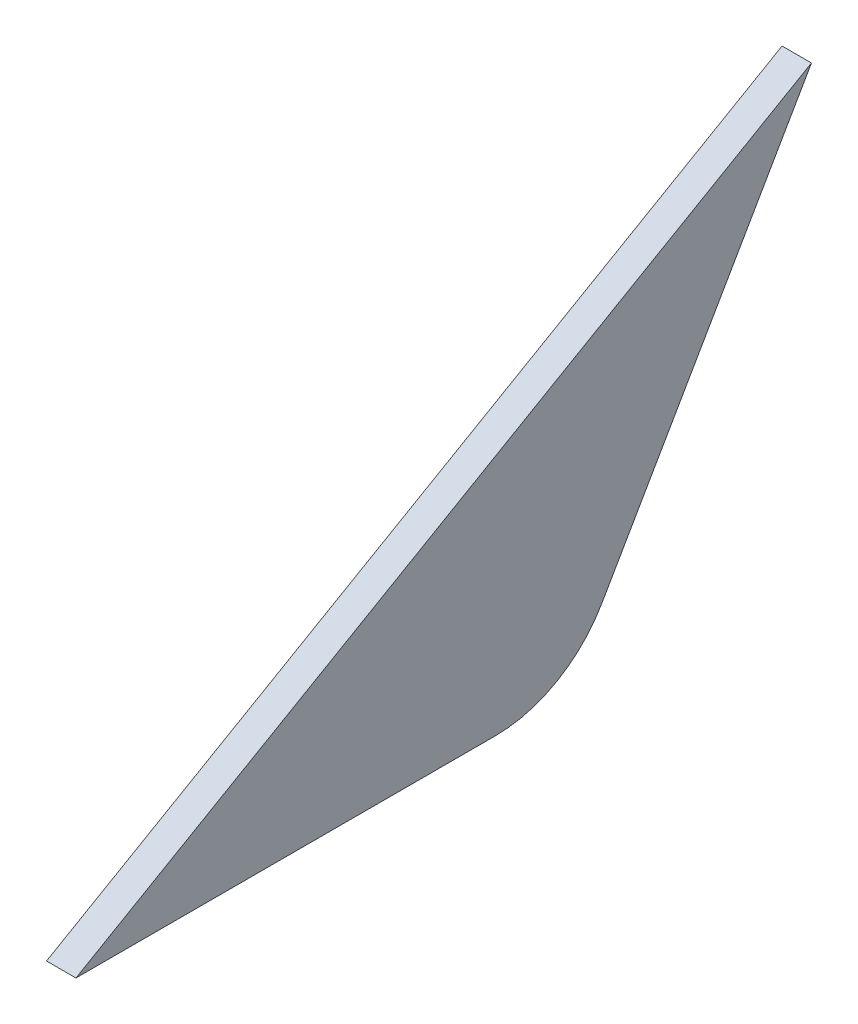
ISO-10303-21;
HEADER;
FILE_DESCRIPTION(('STEP AP214'),'2;1');
FILE_NAME('part.step','',(''),(''),'','','');
FILE_SCHEMA(('AUTOMOTIVE_DESIGN { 1 0 10303 214 1 1 1 1 }'));
ENDSEC;
DATA;
#1=APPLICATION_CONTEXT('core data for automotive mechanical design processes');
#2=APPLICATION_PROTOCOL_DEFINITION('international standard','automotive_design',2000,#1);
#3=PRODUCT_CONTEXT('',#1,'mechanical');
#4=PRODUCT('Part','Part','',(#3));
#5=PRODUCT_RELATED_PRODUCT_CATEGORY('part','',(#4));
#6=PRODUCT_DEFINITION_FORMATION('','',#4);
#7=PRODUCT_DEFINITION_CONTEXT('part definition',#1,'design');
#8=PRODUCT_DEFINITION('design','',#6,#7);
#9=PRODUCT_DEFINITION_SHAPE('','',#8);
#10=(LENGTH_UNIT() NAMED_UNIT(*) SI_UNIT(.MILLI.,.METRE.));
#11=(NAMED_UNIT(*) PLANE_ANGLE_UNIT() SI_UNIT($,.RADIAN.));
#12=(NAMED_UNIT(*) SI_UNIT($,.STERADIAN.) SOLID_ANGLE_UNIT());
#13=UNCERTAINTY_MEASURE_WITH_UNIT(LENGTH_MEASURE(1.E-05),#10,'distance_accuracy_value','');
#14=(GEOMETRIC_REPRESENTATION_CONTEXT(3) GLOBAL_UNCERTAINTY_ASSIGNED_CONTEXT((#13)) GLOBAL_UNIT_ASSIGNED_CONTEXT((#10,
#11,#12)) REPRESENTATION_CONTEXT('',''));
#15=CARTESIAN_POINT('',(0.,0.,0.));
#16=DIRECTION('',(0.,0.,1.));
#17=DIRECTION('',(1.,0.,0.));
#18=AXIS2_PLACEMENT_3D('',#15,#16,#17);
#19=CARTESIAN_POINT('',(343.116830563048,85.0597469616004,-199.739839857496));
#20=DIRECTION('',(0.,-0.866025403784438,-0.5));
#21=DIRECTION('',(0.,0.5,-0.866025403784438));
#22=AXIS2_PLACEMENT_3D('',#19,#20,#21);
#23=PLANE('',#22);
#24=DIRECTION('',(0.,-0.5,0.866025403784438));
#25=VECTOR('',#24,1.);
#26=CARTESIAN_POINT('',(340.068830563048,85.0597469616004,-199.739839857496));
#27=LINE('',#26,#25);
#28=CARTESIAN_POINT('',(340.068830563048,129.05383747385,-275.939839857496));
#29=VERTEX_POINT('',#28);
#30=CARTESIAN_POINT('',(340.068830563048,85.0597469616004,-199.739839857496));
#31=VERTEX_POINT('',#30);
#32=EDGE_CURVE('E98',#29,#31,#27,.T.);
#33=ORIENTED_EDGE('',*,*,#32,.T.);
#34=DIRECTION('',(-1.,0.,0.));
#35=VECTOR('',#34,1.);
#36=CARTESIAN_POINT('',(343.116830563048,85.0597469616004,-199.739839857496));
#37=LINE('',#36,#35);
#38=CARTESIAN_POINT('',(343.116830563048,85.0597469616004,-199.739839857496));
#39=VERTEX_POINT('',#38);
#40=EDGE_CURVE('E11',#39,#31,#37,.T.);
#41=ORIENTED_EDGE('',*,*,#40,.F.);
#42=DIRECTION('',(0.,-0.5,0.866025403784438));
#43=VECTOR('',#42,1.);
#44=CARTESIAN_POINT('',(343.116830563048,85.0597469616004,-199.739839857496));
#45=LINE('',#44,#43);
#46=CARTESIAN_POINT('',(343.116830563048,129.05383747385,-275.939839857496));
#47=VERTEX_POINT('',#46);
#48=EDGE_CURVE('E86',#47,#39,#45,.T.);
#49=ORIENTED_EDGE('',*,*,#48,.F.);
#50=DIRECTION('',(-1.,0.,0.));
#51=VECTOR('',#50,1.);
#52=CARTESIAN_POINT('',(343.116830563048,129.05383747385,-275.939839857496));
#53=LINE('',#52,#51);
#54=EDGE_CURVE('E94',#47,#29,#53,.T.);
#55=ORIENTED_EDGE('',*,*,#54,.T.);
#56=EDGE_LOOP('',(#33,#41,#49,#55));
#57=FACE_BOUND('',#56,.T.);
#58=ADVANCED_FACE('F35',(#57),#23,.F.);
#59=CARTESIAN_POINT('',(343.116830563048,85.0597469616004,-199.739839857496));
#60=DIRECTION('',(0.,1.,0.));
#61=DIRECTION('',(0.,0.,1.));
#62=AXIS2_PLACEMENT_3D('',#59,#60,#61);
#63=PLANE('',#62);
#64=DIRECTION('',(0.,0.,-1.));
#65=VECTOR('',#64,1.);
#66=CARTESIAN_POINT('',(340.068830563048,85.0597469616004,-199.739839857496));
#67=LINE('',#66,#65);
#68=CARTESIAN_POINT('',(340.068830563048,85.0597469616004,-243.207491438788));
#69=VERTEX_POINT('',#68);
#70=EDGE_CURVE('E90',#31,#69,#67,.T.);
#71=ORIENTED_EDGE('',*,*,#70,.T.);
#72=DIRECTION('',(-1.,0.,0.));
#73=VECTOR('',#72,1.);
#74=CARTESIAN_POINT('',(343.116830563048,85.0597469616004,-243.207491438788));
#75=LINE('',#74,#73);
#76=CARTESIAN_POINT('',(343.116830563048,85.0597469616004,-243.207491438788));
#77=VERTEX_POINT('',#76);
#78=EDGE_CURVE('E43',#77,#69,#75,.T.);
#79=ORIENTED_EDGE('',*,*,#78,.F.);
#80=DIRECTION('',(0.,0.,-1.));
#81=VECTOR('',#80,1.);
#82=CARTESIAN_POINT('',(343.116830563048,85.0597469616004,-199.739839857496));
#83=LINE('',#82,#81);
#84=EDGE_CURVE('E81',#39,#77,#83,.T.);
#85=ORIENTED_EDGE('',*,*,#84,.F.);
#86=ORIENTED_EDGE('',*,*,#40,.T.);
#87=EDGE_LOOP('',(#71,#79,#85,#86));
#88=FACE_BOUND('',#87,.T.);
#89=ADVANCED_FACE('F89',(#88),#63,.F.);
#90=CARTESIAN_POINT('',(343.116830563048,97.7597469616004,-243.207491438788));
#91=DIRECTION('',(-1.,0.,0.));
#92=DIRECTION('',(0.,0.,1.));
#93=AXIS2_PLACEMENT_3D('',#90,#91,#92);
#94=CYLINDRICAL_SURFACE('',#93,12.7);
#95=CARTESIAN_POINT('',(340.068830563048,97.7597469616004,-243.207491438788));
#96=DIRECTION('',(1.,0.,0.));
#97=DIRECTION('',(0.,0.,-1.));
#98=AXIS2_PLACEMENT_3D('',#95,#96,#97);
#99=CIRCLE('',#98,12.7);
#100=CARTESIAN_POINT('',(340.068830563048,91.4097469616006,-254.206014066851));
#101=VERTEX_POINT('',#100);
#102=EDGE_CURVE('E68',#69,#101,#99,.T.);
#103=ORIENTED_EDGE('',*,*,#102,.T.);
#104=DIRECTION('',(-1.,0.,0.));
#105=VECTOR('',#104,1.);
#106=CARTESIAN_POINT('',(343.116830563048,91.4097469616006,-254.206014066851));
#107=LINE('',#106,#105);
#108=CARTESIAN_POINT('',(343.116830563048,91.4097469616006,-254.206014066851));
#109=VERTEX_POINT('',#108);
#110=EDGE_CURVE('E91',#109,#101,#107,.T.);
#111=ORIENTED_EDGE('',*,*,#110,.F.);
#112=CARTESIAN_POINT('',(343.116830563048,97.7597469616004,-243.207491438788));
#113=DIRECTION('',(1.,0.,0.));
#114=DIRECTION('',(0.,0.,-1.));
#115=AXIS2_PLACEMENT_3D('',#112,#113,#114);
#116=CIRCLE('',#115,12.7);
#117=EDGE_CURVE('E84',#77,#109,#116,.T.);
#118=ORIENTED_EDGE('',*,*,#117,.F.);
#119=ORIENTED_EDGE('',*,*,#78,.T.);
#120=EDGE_LOOP('',(#103,#111,#118,#119));
#121=FACE_BOUND('',#120,.T.);
#122=ADVANCED_FACE('F92',(#121),#94,.T.);
#123=CARTESIAN_POINT('',(343.116830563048,129.05383747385,-275.939839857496));
#124=DIRECTION('',(0.,0.49999999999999,0.866025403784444));
#125=DIRECTION('',(0.,-0.866025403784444,0.49999999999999));
#126=AXIS2_PLACEMENT_3D('',#123,#124,#125);
#127=PLANE('',#126);
#128=DIRECTION('',(0.,0.866025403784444,-0.49999999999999));
#129=VECTOR('',#128,1.);
#130=CARTESIAN_POINT('',(340.068830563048,129.05383747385,-275.939839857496));
#131=LINE('',#130,#129);
#132=EDGE_CURVE('E74',#101,#29,#131,.T.);
#133=ORIENTED_EDGE('',*,*,#132,.T.);
#134=ORIENTED_EDGE('',*,*,#54,.F.);
#135=DIRECTION('',(0.,0.866025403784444,-0.49999999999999));
#136=VECTOR('',#135,1.);
#137=CARTESIAN_POINT('',(343.116830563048,129.05383747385,-275.939839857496));
#138=LINE('',#137,#136);
#139=EDGE_CURVE('E51',#109,#47,#138,.T.);
#140=ORIENTED_EDGE('',*,*,#139,.F.);
#141=ORIENTED_EDGE('',*,*,#110,.T.);
#142=EDGE_LOOP('',(#133,#134,#140,#141));
#143=FACE_BOUND('',#142,.T.);
#144=ADVANCED_FACE('F105',(#143),#127,.F.);
#145=CARTESIAN_POINT('',(343.116830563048,97.7597469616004,-243.207491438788));
#146=DIRECTION('',(1.,0.,0.));
#147=DIRECTION('',(0.,0.,-1.));
#148=AXIS2_PLACEMENT_3D('',#145,#146,#147);
#149=PLANE('',#148);
#150=ORIENTED_EDGE('',*,*,#48,.T.);
#151=ORIENTED_EDGE('',*,*,#84,.T.);
#152=ORIENTED_EDGE('',*,*,#117,.T.);
#153=ORIENTED_EDGE('',*,*,#139,.T.);
#154=EDGE_LOOP('',(#150,#151,#152,#153));
#155=FACE_BOUND('',#154,.T.);
#156=ADVANCED_FACE('F82',(#155),#149,.T.);
#157=CARTESIAN_POINT('',(340.068830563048,97.7597469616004,-243.207491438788));
#158=DIRECTION('',(1.,0.,0.));
#159=DIRECTION('',(0.,0.,-1.));
#160=AXIS2_PLACEMENT_3D('',#157,#158,#159);
#161=PLANE('',#160);
#162=ORIENTED_EDGE('',*,*,#32,.F.);
#163=ORIENTED_EDGE('',*,*,#132,.F.);
#164=ORIENTED_EDGE('',*,*,#102,.F.);
#165=ORIENTED_EDGE('',*,*,#70,.F.);
#166=EDGE_LOOP('',(#162,#163,#164,#165));
#167=FACE_BOUND('',#166,.T.);
#168=ADVANCED_FACE('F108',(#167),#161,.F.);
#169=CLOSED_SHELL('',(#58,#89,#122,#144,#156,#168));
#170=MANIFOLD_SOLID_BREP('B2',#169);
#171=ADVANCED_BREP_SHAPE_REPRESENTATION('',(#18,#170),#14);
#172=SHAPE_DEFINITION_REPRESENTATION(#9,#171);
ENDSEC;
END-ISO-10303-21;
